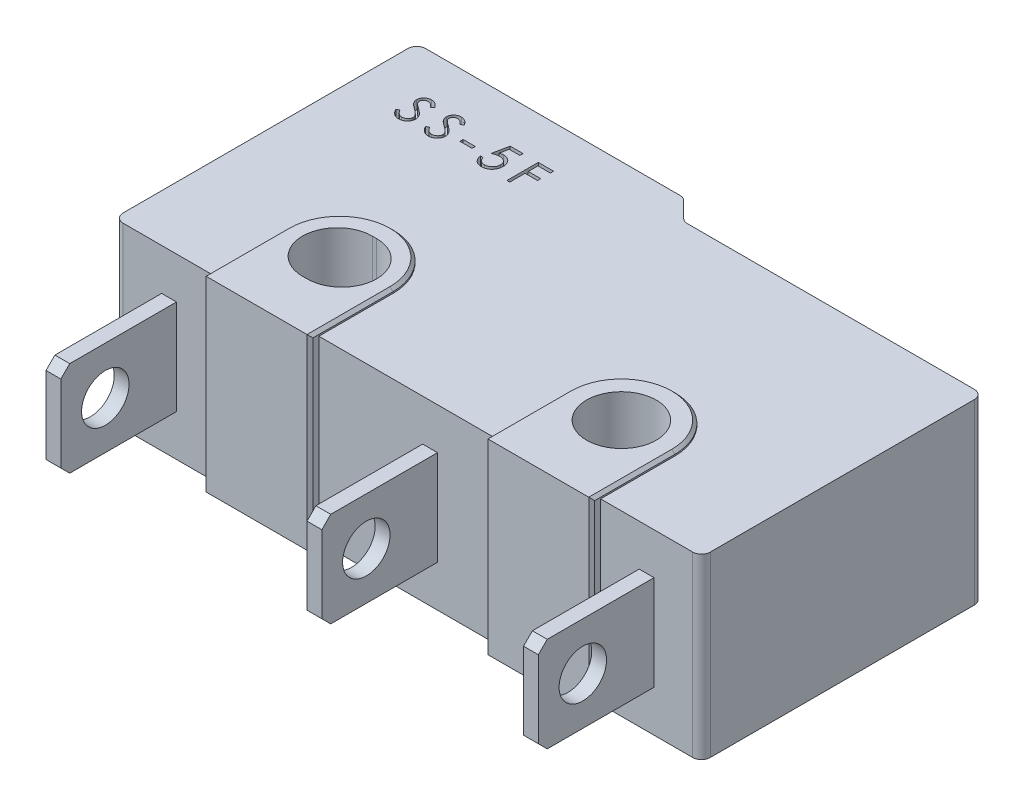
from build123d import *

# Parameters (mm, degrees)
BASE_EXTRUDE_DEPTH  = 6
SKETCH2_R           = 1.175
CUT_EXTRUDE1_DEPTH  = 24.066859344
BOSS_EXTRUDE1_START = 0.15
SKETCH3_R           = 1.175
BOSS_EXTRUDE1_DEPTH = 0.15
SKETCH4_R           = 1.175
BOSS_EXTRUDE2_DEPTH = 0.15
CHAMFER1_SIZE       = 0.1
SKETCH5_W           = 2
SKETCH5_H           = 3.2
BOSS_EXTRUDE3_DEPTH = 1.2
FILLET1_R           = 0.7
SKETCH6_W           = 0.5
SKETCH6_H           = 3.2
BOSS_EXTRUDE4_DEPTH = 3.9
CHAMFER2_SIZE       = 0.3
SKETCH7_R           = 0.8
CUT_EXTRUDE2_DEPTH  = 23.338811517
BOSS_EXTRUDE5_DEPTH = 0.3
CHAMFER3_SIZE       = 0.1
SKETCH12_W          = 0.407051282
SKETCH12_H          = 0.108547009
CUT_EXTRUDE3_DEPTH  = 0.3


with BuildPart() as part:
    # Sketch1 → Base-Extrude (new body)
    with BuildSketch(Plane(origin=(0, 0, 0), x_dir=(1, 0, 0), z_dir=(0, 1, 0))):
        with BuildLine():
            Line((19.5, 9.5), (9.824264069, 9.5))
            ThreePointArc((9.824264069, 9.5), (9.709459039, 9.52283614), (9.612132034, 9.587867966))
            Line((9.612132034, 9.587867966), (9.087867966, 10.112132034))
            ThreePointArc((9.087867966, 10.112132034), (8.990540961, 10.17716386), (8.875735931, 10.2))
            Line((8.875735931, 10.2), (0.3, 10.2))
            ThreePointArc((0.3, 10.2), (0.087867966, 10.112132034), (0, 9.9))
            Line((0, 9.9), (0, 0.3))
            ThreePointArc((0, 0.3), (0.087867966, 0.087867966), (0.3, 0))
            Line((0.3, 0), (19.5, 0))
            ThreePointArc((19.5, 0), (19.712132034, 0.087867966), (19.8, 0.3))
            Line((19.8, 0.3), (19.8, 9.2))
            ThreePointArc((19.8, 9.2), (19.712132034, 9.412132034), (19.5, 9.5))
        make_face()
    extrude(amount=BASE_EXTRUDE_DEPTH)

    # Sketch2 → Cut-Extrude1 (cut, through all)
    with BuildSketch(Plane(origin=(0, 6, 0), x_dir=(-1, 0, 0), z_dir=(0, 1, 0))):
        with Locations(Location((-14.6, -2.5, 0), (0, 0, 90))):
            Circle(SKETCH2_R)
        with BuildLine():
            Line((-5.025, -3.675), (-5.175, -3.675))
            ThreePointArc((-5.175, -3.675), (-6.35, -2.5), (-5.175, -1.325))
            Line((-5.175, -1.325), (-5.025, -1.325))
            ThreePointArc((-5.025, -1.325), (-3.85, -2.5), (-5.025, -3.675))
        make_face()
    extrude(amount=-CUT_EXTRUDE1_DEPTH, mode=Mode.SUBTRACT)

    # Sketch3 → Boss-Extrude1 (add)
    # profile 1 of 2: a face of its own
    with BuildSketch(Plane(origin=(0, 6, 0), x_dir=(-1, 0, 0), z_dir=(0, 1, 0)).offset(BOSS_EXTRUDE1_START)):
        with BuildLine():
            Line((-3.3, 0), (-6.9, 0))
            Line((-6.9, 0), (-6.9, -2.5))
            ThreePointArc((-6.9, -2.5), (-5.1, -4.3), (-3.3, -2.5))
            Line((-3.3, -2.5), (-3.3, 0))
        make_face()
        with BuildLine():
            Line((-5.175, -3.675), (-5.025, -3.675))
            ThreePointArc((-5.025, -3.675), (-3.85, -2.5), (-5.025, -1.325))
            Line((-5.025, -1.325), (-5.175, -1.325))
            ThreePointArc((-5.175, -1.325), (-6.35, -2.5), (-5.175, -3.675))
        make_face(mode=Mode.SUBTRACT)
    # profile 2 of 2: a face of its own
    with BuildSketch(Plane(origin=(0, 6, 0), x_dir=(-1, 0, 0), z_dir=(0, 1, 0)).offset(BOSS_EXTRUDE1_START)):
        with BuildLine():
            Line((-12.8, -2.5), (-12.8, 0))
            Line((-12.8, 0), (-16.4, 0))
            Line((-16.4, 0), (-16.4, -2.5))
            ThreePointArc((-16.4, -2.5), (-14.6, -4.3), (-12.8, -2.5))
        make_face()
        with Locations(Location((-14.6, -2.5, 0), (0, 0, 90))):
            Circle(SKETCH3_R, mode=Mode.SUBTRACT)
    extrude(amount=-BOSS_EXTRUDE1_DEPTH)

    # Sketch4 → Boss-Extrude2 (add)
    # profile 1 of 2: a face of its own
    with BuildSketch(Plane.XZ):
        with BuildLine():
            Line((16.4, 0), (12.8, 0))
            Line((12.8, 0), (12.8, -2.5))
            ThreePointArc((12.8, -2.5), (14.6, -4.3), (16.4, -2.5))
            Line((16.4, -2.5), (16.4, 0))
        make_face()
        with Locations(Location((14.6, -2.5, 0), (0, 0, 90))):
            Circle(SKETCH4_R, mode=Mode.SUBTRACT)
    # profile 2 of 2: a face of its own
    with BuildSketch(Plane.XZ):
        with BuildLine():
            Line((3.3, 0), (3.3, -2.5))
            ThreePointArc((3.3, -2.5), (5.1, -4.3), (6.9, -2.5))
            Line((6.9, -2.5), (6.9, 0))
            Line((6.9, 0), (3.3, 0))
        make_face()
        with BuildLine():
            Line((5.025, -1.325), (5.175, -1.325))
            ThreePointArc((5.175, -1.325), (6.35, -2.5), (5.175, -3.675))
            Line((5.175, -3.675), (5.025, -3.675))
            ThreePointArc((5.025, -3.675), (3.85, -2.5), (5.025, -1.325))
        make_face(mode=Mode.SUBTRACT)
    extrude(amount=BOSS_EXTRUDE2_DEPTH)

    # Chamfer1
    chamfer1_edges = [part.edges().sort_by_distance(p)[0] for p in [
        (5.1, -0.15, -4.3),
        (6.9, -0.15, -1.25),
        (3.3, -0.15, -1.25),
        (3.3, 6.15, -1.25),
        (6.9, 6.15, -1.25),
        (5.1, 6.15, -4.3),
        (16.4, 6.15, -1.25),
        (14.6, 6.15, -4.3),
        (12.8, 6.15, -1.25),
        (12.8, -0.15, -1.25),
        (14.6, -0.15, -4.3),
        (16.4, -0.15, -1.25),
    ]]
    chamfer(chamfer1_edges, length=CHAMFER1_SIZE)

    # Sketch5 → Boss-Extrude3 (add)
    with BuildSketch(Plane(origin=(0, 0, -10.2), x_dir=(-1, 0, 0), z_dir=(0, 0, -1))):
        with Locations((-7.1, 3)):
            Rectangle(SKETCH5_W, SKETCH5_H)
    extrude(amount=BOSS_EXTRUDE3_DEPTH)

    # Fillet1
    fillet1_edges = [part.edges().sort_by_distance(p)[0] for p in [
        (8.1, 3, -11.4),
        (6.1, 3, -11.4),
    ]]
    fillet(fillet1_edges, radius=FILLET1_R)

    # Sketch6 → Boss-Extrude4 (add)
    with BuildSketch(Plane.XY):
        with Locations((1.85, 3)):
            Rectangle(SKETCH6_W, SKETCH6_H)
        with Locations((10.65, 3)):
            Rectangle(SKETCH6_W, SKETCH6_H)
        with Locations((17.95, 3)):
            Rectangle(SKETCH6_W, SKETCH6_H)
    extrude(amount=BOSS_EXTRUDE4_DEPTH)

    # Chamfer2
    chamfer2_edges = [part.edges().sort_by_distance(p)[0] for p in [
        (1.85, 1.4, 3.9),
        (1.85, 4.6, 3.9),
        (10.65, 1.4, 3.9),
        (10.65, 4.6, 3.9),
        (17.95, 1.4, 3.9),
        (17.95, 4.6, 3.9),
    ]]
    chamfer(chamfer2_edges, length=CHAMFER2_SIZE)

    # Sketch7 → Cut-Extrude2 (cut, through all)
    with BuildSketch(Plane.ZY.offset(-1.6)):
        with Locations((2.4, 3)):
            Circle(SKETCH7_R)
    extrude(amount=-CUT_EXTRUDE2_DEPTH, mode=Mode.SUBTRACT)

    # Sketch8 → Boss-Extrude5 (add)
    with BuildSketch(Plane.XY):
        Polygon((16.4, -0.05), (16.4, 6.05), (16.3, 6.15), (12.9, 6.15), (12.8, 6.05), (12.8, -0.05), (12.9, -0.15), (16.3, -0.15), align=None)
        Polygon((6.9, -0.05), (6.9, 6.05), (6.8, 6.15), (3.4, 6.15), (3.3, 6.05), (3.3, -0.05), (3.4, -0.15), (6.8, -0.15), align=None)
    extrude(amount=BOSS_EXTRUDE5_DEPTH)

    # Chamfer3
    chamfer3_edges = [part.edges().sort_by_distance(p)[0] for p in [
        (12.8, 3, 0.3),
        (16.4, 3, 0.3),
        (3.3, 3, 0.3),
        (6.9, 3, 0.3),
    ]]
    chamfer(chamfer3_edges, length=CHAMFER3_SIZE)

    # Sketch12 → Cut-Extrude3 (cut)
    with BuildSketch(Plane(origin=(-12.497117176, 6, -3.291404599), x_dir=(1, 0, 0), z_dir=(0, 1, 0))):
        with BuildLine():
            Line((14.069489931, 4.629493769), (14.158956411, 4.683131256))
            add(Edge.make_bspline(
                [(14.158956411, 4.683131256), (14.167277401, 4.669202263), (14.183220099, 4.642514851), (14.209814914, 4.606453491), (14.237371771, 4.575803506), (14.266094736, 4.550743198), (14.295808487, 4.531013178), (14.326706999, 4.517042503), (14.358686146, 4.508329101), (14.380449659, 4.507270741), (14.391314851, 4.506742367)],
                knots=[0, 0, 0, 0, 1.272034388, 2.437168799, 3.508375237, 4.49857839, 5.41946034, 6.295179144, 7.148887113, 8, 8, 8, 8], degree=3))
            add(Edge.make_bspline(
                [(14.391314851, 4.506742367), (14.400593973, 4.507000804), (14.418989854, 4.507513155), (14.446071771, 4.512436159), (14.472373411, 4.519999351), (14.497352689, 4.530830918), (14.520664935, 4.543935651), (14.541107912, 4.559764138), (14.558780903, 4.577485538), (14.573237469, 4.597256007), (14.584328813, 4.618518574), (14.592853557, 4.640343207), (14.597584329, 4.66307275), (14.598296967, 4.67837639), (14.598656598, 4.686099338)],
                knots=[0, 0, 0, 0, 1.095163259, 2.171163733, 3.241058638, 4.321873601, 5.38011039, 6.391990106, 7.366004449, 8.327778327, 9.272591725, 10.192022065, 11.087607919, 12, 12, 12, 12], degree=3))
            add(Edge.make_bspline(
                [(14.598656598, 4.686099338), (14.598210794, 4.694910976), (14.597304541, 4.712823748), (14.589644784, 4.739251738), (14.577595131, 4.765405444), (14.566478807, 4.781583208), (14.560707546, 4.789982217)],
                knots=[0, 0, 0, 0, 0.938893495, 1.908633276, 2.914225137, 4, 4, 4, 4], degree=3))
            add(Edge.make_bspline(
                [(14.560707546, 4.789982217), (14.555969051, 4.796043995), (14.546021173, 4.808769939), (14.528919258, 4.827712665), (14.508851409, 4.847252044), (14.486504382, 4.868134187), (14.461064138, 4.889387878), (14.433327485, 4.912026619), (14.402586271, 4.935189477), (14.381026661, 4.950723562), (14.369902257, 4.958738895)],
                knots=[0, 0, 0, 0, 0.722233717, 1.516239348, 2.393582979, 3.351407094, 4.387010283, 5.505090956, 6.712668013, 8, 8, 8, 8], degree=3))
            add(Edge.make_bspline(
                [(14.369902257, 4.958738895), (14.358767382, 4.96666992), (14.337478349, 4.981833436), (14.307706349, 5.004337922), (14.281083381, 5.024913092), (14.257727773, 5.043752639), (14.2376498, 5.060859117), (14.220691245, 5.076068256), (14.20728411, 5.08979138), (14.199828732, 5.098693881), (14.196481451, 5.102690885)],
                knots=[0, 0, 0, 0, 1.452282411, 2.77665338, 3.964542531, 5.026858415, 5.96415736, 6.766646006, 7.446254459, 8, 8, 8, 8], degree=3))
            add(Edge.make_bspline(
                [(14.196481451, 5.102690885), (14.191802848, 5.108920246), (14.182601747, 5.12117112), (14.170456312, 5.140319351), (14.16013328, 5.159920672), (14.15204086, 5.180027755), (14.145226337, 5.200358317), (14.140642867, 5.221177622), (14.13777285, 5.242392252), (14.137478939, 5.256668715), (14.137331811, 5.26381535)],
                knots=[0, 0, 0, 0, 1.068054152, 2.10047183, 3.106115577, 4.101338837, 5.06977816, 6.043150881, 7.020423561, 8, 8, 8, 8], degree=3))
            add(Edge.make_bspline(
                [(14.137331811, 5.26381535), (14.137726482, 5.275012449), (14.138507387, 5.297167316), (14.145111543, 5.3295314), (14.155535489, 5.360430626), (14.170138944, 5.389559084), (14.188964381, 5.416158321), (14.210749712, 5.440534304), (14.236697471, 5.461026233), (14.26516743, 5.478930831), (14.296329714, 5.492944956), (14.328984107, 5.503516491), (14.363182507, 5.509506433), (14.386345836, 5.510366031), (14.398099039, 5.510802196)],
                knots=[0, 0, 0, 0, 1.005424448, 1.989358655, 2.955360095, 3.929531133, 4.905563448, 5.876582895, 6.856512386, 7.866279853, 8.892233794, 9.918561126, 10.94386622, 12, 12, 12, 12], degree=3))
            add(Edge.make_bspline(
                [(14.398099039, 5.510802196), (14.410570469, 5.510372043), (14.435372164, 5.509516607), (14.471854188, 5.502078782), (14.506978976, 5.489771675), (14.53523444, 5.475805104), (14.557348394, 5.461855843), (14.574213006, 5.449149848), (14.591302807, 5.434522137), (14.608755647, 5.417933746), (14.626275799, 5.399232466), (14.644123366, 5.378546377), (14.662340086, 5.356001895), (14.67405912, 5.339907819), (14.680066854, 5.331657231)],
                knots=[0, 0, 0, 0, 1.286793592, 2.559021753, 3.825965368, 5.121522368, 5.803751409, 6.523245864, 7.299691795, 8.125521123, 9.008227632, 9.944561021, 10.946284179, 12, 12, 12, 12], degree=3))
            Line((14.680066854, 5.331657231), (14.594204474, 5.266571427))
            add(Edge.make_bspline(
                [(14.594204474, 5.266571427), (14.589019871, 5.273250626), (14.579035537, 5.286113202), (14.563877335, 5.304126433), (14.549590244, 5.32058094), (14.53551429, 5.334873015), (14.522392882, 5.347785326), (14.509657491, 5.3588403), (14.497491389, 5.368146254), (14.482155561, 5.378077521), (14.462888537, 5.387921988), (14.438702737, 5.396252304), (14.413427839, 5.40125824), (14.396213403, 5.401920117), (14.387498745, 5.402255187)],
                knots=[0, 0, 0, 0, 1.181633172, 2.275549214, 3.290209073, 4.226197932, 5.078386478, 5.862611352, 6.581680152, 7.217281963, 8.414376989, 9.595101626, 10.782541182, 12, 12, 12, 12], degree=3))
            add(Edge.make_bspline(
                [(14.387498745, 5.402255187), (14.376565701, 5.401888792), (14.355482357, 5.401182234), (14.325549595, 5.393465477), (14.298609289, 5.381315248), (14.275461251, 5.364286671), (14.256188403, 5.344111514), (14.242246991, 5.32089505), (14.23385587, 5.295258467), (14.232831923, 5.277375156), (14.232310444, 5.268267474)],
                knots=[0, 0, 0, 0, 1.14458467, 2.207223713, 3.21896685, 4.227309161, 5.202851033, 6.127160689, 7.046193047, 8, 8, 8, 8], degree=3))
            add(Edge.make_bspline(
                [(14.232310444, 5.268267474), (14.232429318, 5.262597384), (14.23266726, 5.251247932), (14.23598583, 5.234480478), (14.240249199, 5.217755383), (14.247005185, 5.20114784), (14.256332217, 5.184367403), (14.268580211, 5.167125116), (14.284005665, 5.149269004), (14.295821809, 5.137655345), (14.302060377, 5.131523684)],
                knots=[0, 0, 0, 0, 0.858281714, 1.717966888, 2.583508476, 3.4729293, 4.427298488, 5.488583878, 6.674047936, 8, 8, 8, 8], degree=3))
            add(Edge.make_bspline(
                [(14.302060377, 5.131523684), (14.30437703, 5.129456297), (14.309880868, 5.12454466), (14.319942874, 5.116503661), (14.333230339, 5.106584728), (14.34939629, 5.094311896), (14.368738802, 5.080075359), (14.391260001, 5.064057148), (14.416708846, 5.045737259), (14.434767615, 5.032929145), (14.44431632, 5.026156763)],
                knots=[0, 0, 0, 0, 0.420754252, 0.999615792, 1.744751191, 2.668019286, 3.750313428, 4.999500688, 6.413464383, 8, 8, 8, 8], degree=3))
            add(Edge.make_bspline(
                [(14.44431632, 5.026156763), (14.455802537, 5.017798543), (14.478044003, 5.001614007), (14.509690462, 4.977297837), (14.538384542, 4.95351625), (14.564226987, 4.930421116), (14.5874731, 4.908187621), (14.607864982, 4.886548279), (14.625610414, 4.865658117), (14.644714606, 4.838875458), (14.664235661, 4.80598213), (14.681000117, 4.765681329), (14.691570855, 4.72522387), (14.692953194, 4.698031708), (14.69363523, 4.684615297)],
                knots=[0, 0, 0, 0, 1.163667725, 2.253281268, 3.268753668, 4.215851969, 5.092017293, 5.902905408, 6.650798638, 7.335211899, 8.59617414, 9.77448103, 10.901945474, 12, 12, 12, 12], degree=3))
            add(Edge.make_bspline(
                [(14.69363523, 4.684615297), (14.693436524, 4.675127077), (14.693042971, 4.656334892), (14.688519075, 4.628741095), (14.681890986, 4.601940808), (14.671901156, 4.576265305), (14.659708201, 4.551244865), (14.644236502, 4.527535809), (14.626302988, 4.504613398), (14.605730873, 4.483088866), (14.58321985, 4.463329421), (14.5594274, 4.4457523), (14.534314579, 4.431096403), (14.508017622, 4.419136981), (14.480530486, 4.409783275), (14.451862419, 4.40300605), (14.421966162, 4.398846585), (14.401646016, 4.398414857), (14.391314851, 4.398195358)],
                knots=[0, 0, 0, 0, 0.983748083, 1.948392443, 2.894712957, 3.844097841, 4.80183111, 5.778335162, 6.776009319, 7.81870978, 8.863265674, 9.881300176, 10.883814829, 11.87499822, 12.874611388, 13.892143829, 14.928324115, 16, 16, 16, 16], degree=3))
            add(Edge.make_bspline(
                [(14.391314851, 4.398195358), (14.383321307, 4.39834993), (14.367434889, 4.398657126), (14.343937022, 4.401372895), (14.32091386, 4.405215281), (14.298654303, 4.411315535), (14.276871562, 4.418716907), (14.255660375, 4.427830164), (14.235010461, 4.438751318), (14.214806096, 4.451238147), (14.195098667, 4.465769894), (14.176073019, 4.482695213), (14.157104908, 4.501547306), (14.138754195, 4.522838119), (14.120649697, 4.546223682), (14.103148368, 4.571922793), (14.085887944, 4.599795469), (14.075058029, 4.619409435), (14.069489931, 4.629493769)],
                knots=[0, 0, 0, 0, 0.915332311, 1.819136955, 2.706846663, 3.586547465, 4.459518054, 5.340707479, 6.227863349, 7.133153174, 8.059268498, 9.028702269, 10.047606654, 11.120612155, 12.245963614, 13.433783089, 14.680604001, 16, 16, 16, 16], degree=3))
        make_face()
        with BuildLine():
            Line((15.070836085, 4.629493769), (15.160302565, 4.683131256))
            add(Edge.make_bspline(
                [(15.160302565, 4.683131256), (15.168623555, 4.669202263), (15.184566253, 4.642514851), (15.211161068, 4.606453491), (15.238717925, 4.575803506), (15.26744089, 4.550743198), (15.297154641, 4.531013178), (15.328053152, 4.517042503), (15.3600323, 4.508329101), (15.381795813, 4.507270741), (15.392661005, 4.506742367)],
                knots=[0, 0, 0, 0, 1.272034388, 2.437168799, 3.508375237, 4.49857839, 5.41946034, 6.295179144, 7.148887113, 8, 8, 8, 8], degree=3))
            add(Edge.make_bspline(
                [(15.392661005, 4.506742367), (15.401940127, 4.507000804), (15.420336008, 4.507513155), (15.447417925, 4.512436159), (15.473719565, 4.519999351), (15.498698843, 4.530830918), (15.522011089, 4.543935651), (15.542454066, 4.559764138), (15.560127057, 4.577485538), (15.574583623, 4.597256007), (15.585674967, 4.618518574), (15.594199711, 4.640343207), (15.598930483, 4.66307275), (15.599643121, 4.67837639), (15.600002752, 4.686099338)],
                knots=[0, 0, 0, 0, 1.095163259, 2.171163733, 3.241058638, 4.321873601, 5.38011039, 6.391990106, 7.366004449, 8.327778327, 9.272591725, 10.192022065, 11.087607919, 12, 12, 12, 12], degree=3))
            add(Edge.make_bspline(
                [(15.600002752, 4.686099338), (15.599556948, 4.694910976), (15.598650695, 4.712823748), (15.590990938, 4.739251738), (15.578941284, 4.765405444), (15.567824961, 4.781583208), (15.5620537, 4.789982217)],
                knots=[0, 0, 0, 0, 0.938893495, 1.908633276, 2.914225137, 4, 4, 4, 4], degree=3))
            add(Edge.make_bspline(
                [(15.5620537, 4.789982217), (15.557315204, 4.796043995), (15.547367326, 4.808769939), (15.530265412, 4.827712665), (15.510197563, 4.847252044), (15.487850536, 4.868134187), (15.462410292, 4.889387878), (15.434673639, 4.912026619), (15.403932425, 4.935189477), (15.382372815, 4.950723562), (15.371248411, 4.958738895)],
                knots=[0, 0, 0, 0, 0.722233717, 1.516239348, 2.393582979, 3.351407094, 4.387010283, 5.505090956, 6.712668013, 8, 8, 8, 8], degree=3))
            add(Edge.make_bspline(
                [(15.371248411, 4.958738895), (15.360113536, 4.96666992), (15.338824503, 4.981833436), (15.309052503, 5.004337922), (15.282429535, 5.024913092), (15.259073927, 5.043752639), (15.238995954, 5.060859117), (15.222037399, 5.076068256), (15.208630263, 5.08979138), (15.201174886, 5.098693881), (15.197827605, 5.102690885)],
                knots=[0, 0, 0, 0, 1.452282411, 2.77665338, 3.964542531, 5.026858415, 5.96415736, 6.766646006, 7.446254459, 8, 8, 8, 8], degree=3))
            add(Edge.make_bspline(
                [(15.197827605, 5.102690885), (15.193149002, 5.108920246), (15.183947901, 5.12117112), (15.171802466, 5.140319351), (15.161479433, 5.159920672), (15.153387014, 5.180027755), (15.146572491, 5.200358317), (15.141989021, 5.221177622), (15.139119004, 5.242392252), (15.138825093, 5.256668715), (15.138677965, 5.26381535)],
                knots=[0, 0, 0, 0, 1.068054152, 2.10047183, 3.106115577, 4.101338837, 5.06977816, 6.043150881, 7.020423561, 8, 8, 8, 8], degree=3))
            add(Edge.make_bspline(
                [(15.138677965, 5.26381535), (15.139072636, 5.275012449), (15.13985354, 5.297167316), (15.146457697, 5.3295314), (15.156881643, 5.360430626), (15.171485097, 5.389559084), (15.190310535, 5.416158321), (15.212095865, 5.440534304), (15.238043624, 5.461026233), (15.266513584, 5.478930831), (15.297675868, 5.492944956), (15.33033026, 5.503516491), (15.364528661, 5.509506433), (15.38769199, 5.510366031), (15.399445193, 5.510802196)],
                knots=[0, 0, 0, 0, 1.005424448, 1.989358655, 2.955360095, 3.929531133, 4.905563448, 5.876582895, 6.856512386, 7.866279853, 8.892233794, 9.918561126, 10.94386622, 12, 12, 12, 12], degree=3))
            add(Edge.make_bspline(
                [(15.399445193, 5.510802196), (15.411916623, 5.510372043), (15.436718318, 5.509516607), (15.473200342, 5.502078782), (15.50832513, 5.489771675), (15.536580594, 5.475805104), (15.558694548, 5.461855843), (15.57555916, 5.449149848), (15.59264896, 5.434522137), (15.610101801, 5.417933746), (15.627621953, 5.399232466), (15.64546952, 5.378546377), (15.66368624, 5.356001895), (15.675405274, 5.339907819), (15.681413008, 5.331657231)],
                knots=[0, 0, 0, 0, 1.286793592, 2.559021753, 3.825965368, 5.121522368, 5.803751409, 6.523245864, 7.299691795, 8.125521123, 9.008227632, 9.944561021, 10.946284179, 12, 12, 12, 12], degree=3))
            Line((15.681413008, 5.331657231), (15.595550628, 5.266571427))
            add(Edge.make_bspline(
                [(15.595550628, 5.266571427), (15.590366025, 5.273250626), (15.580381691, 5.286113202), (15.565223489, 5.304126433), (15.550936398, 5.32058094), (15.536860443, 5.334873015), (15.523739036, 5.347785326), (15.511003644, 5.3588403), (15.498837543, 5.368146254), (15.483501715, 5.378077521), (15.464234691, 5.387921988), (15.440048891, 5.396252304), (15.414773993, 5.40125824), (15.397559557, 5.401920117), (15.388844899, 5.402255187)],
                knots=[0, 0, 0, 0, 1.181633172, 2.275549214, 3.290209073, 4.226197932, 5.078386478, 5.862611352, 6.581680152, 7.217281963, 8.414376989, 9.595101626, 10.782541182, 12, 12, 12, 12], degree=3))
            add(Edge.make_bspline(
                [(15.388844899, 5.402255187), (15.377911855, 5.401888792), (15.35682851, 5.401182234), (15.326895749, 5.393465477), (15.299955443, 5.381315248), (15.276807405, 5.364286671), (15.257534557, 5.344111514), (15.243593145, 5.32089505), (15.235202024, 5.295258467), (15.234178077, 5.277375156), (15.233656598, 5.268267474)],
                knots=[0, 0, 0, 0, 1.14458467, 2.207223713, 3.21896685, 4.227309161, 5.202851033, 6.127160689, 7.046193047, 8, 8, 8, 8], degree=3))
            add(Edge.make_bspline(
                [(15.233656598, 5.268267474), (15.233775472, 5.262597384), (15.234013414, 5.251247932), (15.237331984, 5.234480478), (15.241595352, 5.217755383), (15.248351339, 5.20114784), (15.257678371, 5.184367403), (15.269926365, 5.167125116), (15.285351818, 5.149269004), (15.297167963, 5.137655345), (15.303406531, 5.131523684)],
                knots=[0, 0, 0, 0, 0.858281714, 1.717966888, 2.583508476, 3.4729293, 4.427298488, 5.488583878, 6.674047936, 8, 8, 8, 8], degree=3))
            add(Edge.make_bspline(
                [(15.303406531, 5.131523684), (15.305723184, 5.129456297), (15.311227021, 5.12454466), (15.321289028, 5.116503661), (15.334576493, 5.106584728), (15.350742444, 5.094311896), (15.370084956, 5.080075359), (15.392606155, 5.064057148), (15.418054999, 5.045737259), (15.436113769, 5.032929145), (15.445662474, 5.026156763)],
                knots=[0, 0, 0, 0, 0.420754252, 0.999615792, 1.744751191, 2.668019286, 3.750313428, 4.999500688, 6.413464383, 8, 8, 8, 8], degree=3))
            add(Edge.make_bspline(
                [(15.445662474, 5.026156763), (15.45714869, 5.017798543), (15.479390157, 5.001614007), (15.511036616, 4.977297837), (15.539730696, 4.95351625), (15.565573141, 4.930421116), (15.588819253, 4.908187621), (15.609211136, 4.886548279), (15.626956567, 4.865658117), (15.64606076, 4.838875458), (15.665581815, 4.80598213), (15.682346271, 4.765681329), (15.692917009, 4.72522387), (15.694299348, 4.698031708), (15.694981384, 4.684615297)],
                knots=[0, 0, 0, 0, 1.163667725, 2.253281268, 3.268753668, 4.215851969, 5.092017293, 5.902905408, 6.650798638, 7.335211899, 8.59617414, 9.77448103, 10.901945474, 12, 12, 12, 12], degree=3))
            add(Edge.make_bspline(
                [(15.694981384, 4.684615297), (15.694782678, 4.675127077), (15.694389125, 4.656334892), (15.689865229, 4.628741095), (15.68323714, 4.601940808), (15.67324731, 4.576265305), (15.661054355, 4.551244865), (15.645582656, 4.527535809), (15.627649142, 4.504613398), (15.607077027, 4.483088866), (15.584566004, 4.463329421), (15.560773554, 4.4457523), (15.535660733, 4.431096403), (15.509363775, 4.419136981), (15.48187664, 4.409783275), (15.453208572, 4.40300605), (15.423312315, 4.398846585), (15.40299217, 4.398414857), (15.392661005, 4.398195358)],
                knots=[0, 0, 0, 0, 0.983748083, 1.948392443, 2.894712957, 3.844097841, 4.80183111, 5.778335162, 6.776009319, 7.81870978, 8.863265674, 9.881300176, 10.883814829, 11.87499822, 12.874611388, 13.892143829, 14.928324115, 16, 16, 16, 16], degree=3))
            add(Edge.make_bspline(
                [(15.392661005, 4.398195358), (15.384667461, 4.39834993), (15.368781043, 4.398657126), (15.345283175, 4.401372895), (15.322260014, 4.405215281), (15.300000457, 4.411315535), (15.278217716, 4.418716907), (15.257006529, 4.427830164), (15.236356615, 4.438751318), (15.21615225, 4.451238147), (15.196444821, 4.465769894), (15.177419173, 4.482695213), (15.158451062, 4.501547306), (15.140100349, 4.522838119), (15.121995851, 4.546223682), (15.104494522, 4.571922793), (15.087234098, 4.599795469), (15.076404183, 4.619409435), (15.070836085, 4.629493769)],
                knots=[0, 0, 0, 0, 0.915332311, 1.819136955, 2.706846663, 3.586547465, 4.459518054, 5.340707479, 6.227863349, 7.133153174, 8.059268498, 9.028702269, 10.047606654, 11.120612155, 12.245963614, 13.433783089, 14.680604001, 16, 16, 16, 16], degree=3))
        make_face()
        with Locations((16.289276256, 4.832383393)):
            Rectangle(SKETCH12_W, SKETCH12_H)
        with BuildLine():
            Line((17.507716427, 5.483665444), (17.507716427, 5.375118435))
            Line((17.507716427, 5.375118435), (17.147730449, 5.375118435))
            Line((17.147730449, 5.375118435), (17.090700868, 5.09675472))
            add(Edge.make_bspline(
                [(17.090700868, 5.09675472), (17.101905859, 5.099848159), (17.123613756, 5.105841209), (17.155654, 5.112495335), (17.186071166, 5.116506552), (17.205809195, 5.117054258), (17.215360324, 5.11731929)],
                knots=[0, 0, 0, 0, 1.100273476, 2.13160584, 3.095893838, 4, 4, 4, 4], degree=3))
            add(Edge.make_bspline(
                [(17.215360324, 5.11731929), (17.227178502, 5.117063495), (17.250415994, 5.116560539), (17.28441539, 5.111730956), (17.316870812, 5.104129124), (17.347714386, 5.093509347), (17.377003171, 5.079929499), (17.404467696, 5.062965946), (17.430520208, 5.043149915), (17.454693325, 5.020367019), (17.476623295, 4.995293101), (17.495904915, 4.968333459), (17.512282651, 4.939750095), (17.525454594, 4.909269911), (17.535972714, 4.877229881), (17.542973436, 4.843292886), (17.547635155, 4.807778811), (17.548155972, 4.783496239), (17.548421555, 4.771113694)],
                knots=[0, 0, 0, 0, 1.052922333, 2.070308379, 3.05430497, 4.020497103, 4.973039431, 5.925935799, 6.892292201, 7.88610001, 8.88166317, 9.857072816, 10.836096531, 11.812156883, 12.81219415, 13.836441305, 14.89672472, 16, 16, 16, 16], degree=3))
            add(Edge.make_bspline(
                [(17.548421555, 4.771113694), (17.548220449, 4.762489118), (17.547820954, 4.74535652), (17.545789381, 4.719912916), (17.541877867, 4.695007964), (17.536626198, 4.67063836), (17.529809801, 4.64685024), (17.52155811, 4.623575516), (17.511459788, 4.600959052), (17.500383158, 4.578786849), (17.487911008, 4.557560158), (17.47406846, 4.537709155), (17.459443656, 4.51893605), (17.443707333, 4.501442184), (17.426713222, 4.485342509), (17.408667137, 4.470541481), (17.389713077, 4.456788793), (17.369557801, 4.444642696), (17.348650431, 4.433465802), (17.326689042, 4.424296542), (17.304173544, 4.416098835), (17.28077988, 4.409564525), (17.256561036, 4.404444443), (17.231477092, 4.400966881), (17.205659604, 4.398434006), (17.188159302, 4.39827545), (17.179319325, 4.398195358)],
                knots=[0, 0, 0, 0, 1.056347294, 2.098418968, 3.122841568, 4.141288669, 5.149314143, 6.15115421, 7.162517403, 8.180376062, 9.185164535, 10.17417709, 11.141909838, 12.097768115, 13.052685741, 14.0056014, 14.954263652, 15.917497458, 16.885230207, 17.854509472, 18.828990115, 19.81800267, 20.826176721, 21.857883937, 22.917946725, 24, 24, 24, 24], degree=3))
            add(Edge.make_bspline(
                [(17.179319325, 4.398195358), (17.168774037, 4.398404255), (17.148027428, 4.398815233), (17.117631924, 4.403114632), (17.088387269, 4.409272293), (17.060528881, 4.418536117), (17.033807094, 4.430143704), (17.008581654, 4.44481407), (16.984208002, 4.461438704), (16.961676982, 4.481057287), (16.94076549, 4.502500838), (16.922046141, 4.525771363), (16.905374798, 4.55048479), (16.891018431, 4.576761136), (16.878772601, 4.604531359), (16.869152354, 4.633899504), (16.861387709, 4.664712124), (16.858102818, 4.68592521), (16.856434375, 4.696699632)],
                knots=[0, 0, 0, 0, 1.0467383, 2.05933395, 3.04377827, 4.011590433, 4.970194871, 5.932262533, 6.905835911, 7.896367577, 8.894135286, 9.877477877, 10.858688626, 11.851381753, 12.8477658, 13.868841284, 14.917554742, 16, 16, 16, 16], degree=3))
            Line((16.856434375, 4.696699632), (16.951413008, 4.696699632))
            add(Edge.make_bspline(
                [(16.951413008, 4.696699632), (16.953749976, 4.686607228), (16.95824176, 4.667209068), (16.968101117, 4.639955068), (16.980155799, 4.615668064), (16.994489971, 4.594026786), (17.011589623, 4.575155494), (17.031102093, 4.558337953), (17.052978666, 4.54316595), (17.077288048, 4.530519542), (17.102933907, 4.51973399), (17.129775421, 4.51255193), (17.157081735, 4.507501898), (17.175550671, 4.50699639), (17.184831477, 4.506742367)],
                knots=[0, 0, 0, 0, 1.136247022, 2.183929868, 3.172523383, 4.106158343, 5.02341133, 5.958108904, 6.928429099, 7.938127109, 8.96079061, 9.975095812, 10.982467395, 12, 12, 12, 12], degree=3))
            add(Edge.make_bspline(
                [(17.184831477, 4.506742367), (17.19389034, 4.506990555), (17.211727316, 4.507479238), (17.237977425, 4.511240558), (17.263320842, 4.517033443), (17.287507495, 4.525702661), (17.310960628, 4.53623904), (17.333086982, 4.549760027), (17.354526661, 4.565320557), (17.374613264, 4.583147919), (17.393009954, 4.602793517), (17.409264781, 4.623802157), (17.422804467, 4.64621368), (17.434214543, 4.669640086), (17.442878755, 4.694338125), (17.449059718, 4.720192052), (17.452689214, 4.747265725), (17.4531885, 4.765731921), (17.453442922, 4.775141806)],
                knots=[0, 0, 0, 0, 1.027316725, 2.022795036, 3.002884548, 3.971462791, 4.93288096, 5.914575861, 6.907176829, 7.935150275, 8.956128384, 9.956726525, 10.942570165, 11.921478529, 12.907843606, 13.90538589, 14.932640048, 16, 16, 16, 16], degree=3))
            add(Edge.make_bspline(
                [(17.453442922, 4.775141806), (17.453243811, 4.783631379), (17.452854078, 4.800248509), (17.449669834, 4.824559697), (17.444131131, 4.847562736), (17.436443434, 4.869368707), (17.426682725, 4.889998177), (17.414754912, 4.909472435), (17.400436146, 4.927534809), (17.384079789, 4.944193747), (17.366161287, 4.959568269), (17.346372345, 4.972674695), (17.325127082, 4.983700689), (17.302681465, 4.993216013), (17.278501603, 5.000050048), (17.253066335, 5.005180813), (17.226100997, 5.008148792), (17.207664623, 5.008560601), (17.198187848, 5.008772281)],
                knots=[0, 0, 0, 0, 1.045622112, 2.046656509, 3.013763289, 3.955457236, 4.890082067, 5.820317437, 6.762574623, 7.722996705, 8.69280354, 9.665887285, 10.63943826, 11.638615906, 12.663482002, 13.728887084, 14.832589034, 16, 16, 16, 16], degree=3))
            add(Edge.make_bspline(
                [(17.198187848, 5.008772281), (17.189984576, 5.008596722), (17.173046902, 5.008234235), (17.147065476, 5.005565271), (17.119762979, 5.00125958), (17.091244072, 4.995337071), (17.061423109, 4.987586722), (17.030363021, 4.978299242), (16.997998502, 4.967195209), (16.976191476, 4.958809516), (16.964981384, 4.954498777)],
                knots=[0, 0, 0, 0, 0.817624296, 1.688186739, 2.600797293, 3.572016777, 4.590301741, 5.671205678, 6.80286297, 8, 8, 8, 8], degree=3))
            Line((16.964981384, 4.954498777), (17.073528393, 5.483665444))
            Line((17.073528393, 5.483665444), (17.507716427, 5.483665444))
        make_face()
        Polygon((18.020601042, 5.483665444), (18.536199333, 5.483665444), (18.536199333, 5.375118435), (18.115579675, 5.375118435), (18.115579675, 5.04947741), (18.536199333, 5.04947741), (18.536199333, 4.940930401), (18.115579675, 4.940930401), (18.115579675, 4.42533211), (18.020601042, 4.42533211), align=None)
    extrude(amount=-CUT_EXTRUDE3_DEPTH, mode=Mode.SUBTRACT)


solid = part.part
